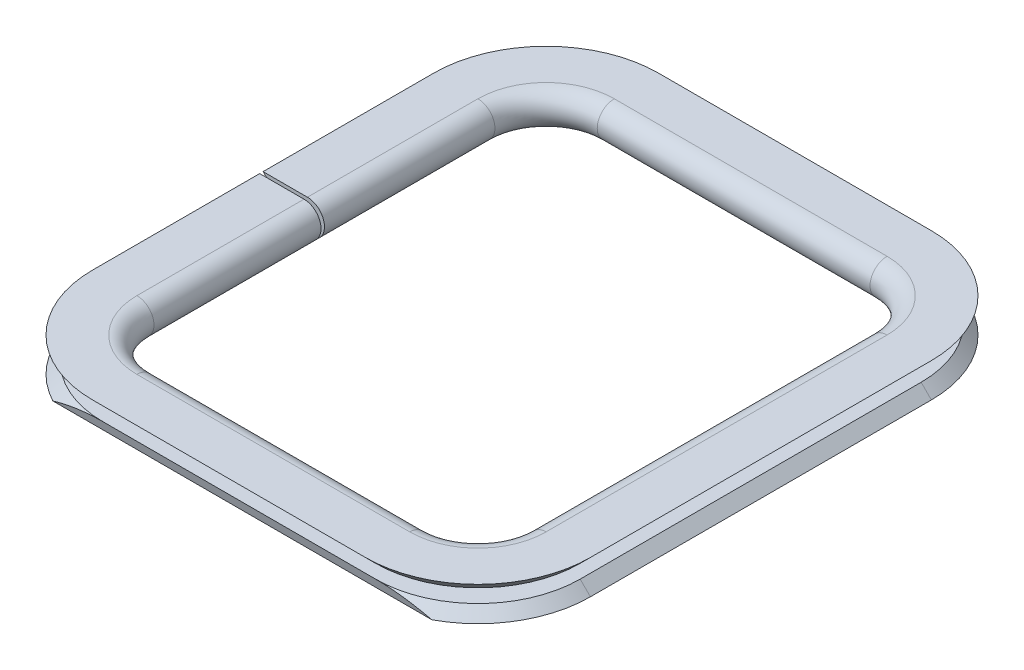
from build123d import *

# Parameters (mm, degrees)
ENL_V_MAT_EXTRU_1_DEPTH      = 79.42671739
ENL_V_MAT_EXTRU_1_DEPTH_BACK = 79.42671739


with BuildPart() as part:
    # Balayage1: sweep along a path in Esquisse2
    with BuildLine(Plane(origin=(0, 0, 0), x_dir=(1, 0, 0), z_dir=(0, 1, 0))) as balayage1_path:
        Line((0, 0), (0, 25))
        ThreePointArc((0, 25), (2.928932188, 32.071067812), (10, 35))
        Line((10, 35), (50, 35))
        ThreePointArc((50, 35), (57.071067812, 32.071067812), (60, 25))
        Line((60, 25), (60, -25))
        ThreePointArc((60, -25), (57.071067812, -32.071067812), (50, -35))
        Line((50, -35), (10, -35))
        ThreePointArc((10, -35), (2.928932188, -32.071067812), (0, -25))
        Line((0, -25), (0, -0.5))
    # Esquisse1 → Balayage1 (sweep)
    with BuildSketch(Plane.XY):
        with BuildLine():
            Line((0, -1), (0, 1))
            Line((0, 1), (-5, 1))
            Line((-5, 1), (-6.5, 2.5))
            Line((-6.5, 2.5), (0, 2.5))
            ThreePointArc((0, 2.5), (2.5, 0), (0, -2.5))
            Line((0, -2.5), (-6.5, -2.5))
            Line((-6.5, -2.5), (-5, -1))
            Line((-5, -1), (0, -1))
        make_face()
    sweep(path=balayage1_path.line)

    # Esquisse3 → Enl_v. mat.-Extru.1 (cut, two sides: drawn at the far end of the back side and taken through both)
    with BuildSketch(Plane(origin=(0, 0, 0), x_dir=(0, 0, -1), z_dir=(1, 0, 0)).offset(-ENL_V_MAT_EXTRU_1_DEPTH_BACK)):
        Polygon((-40, -1), (-43.95658592, -1), (-43.95658592, -4.130810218), (-39.042815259, -4.130810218), align=None)
    extrude(amount=ENL_V_MAT_EXTRU_1_DEPTH + ENL_V_MAT_EXTRU_1_DEPTH_BACK, mode=Mode.SUBTRACT)


solid = part.part
